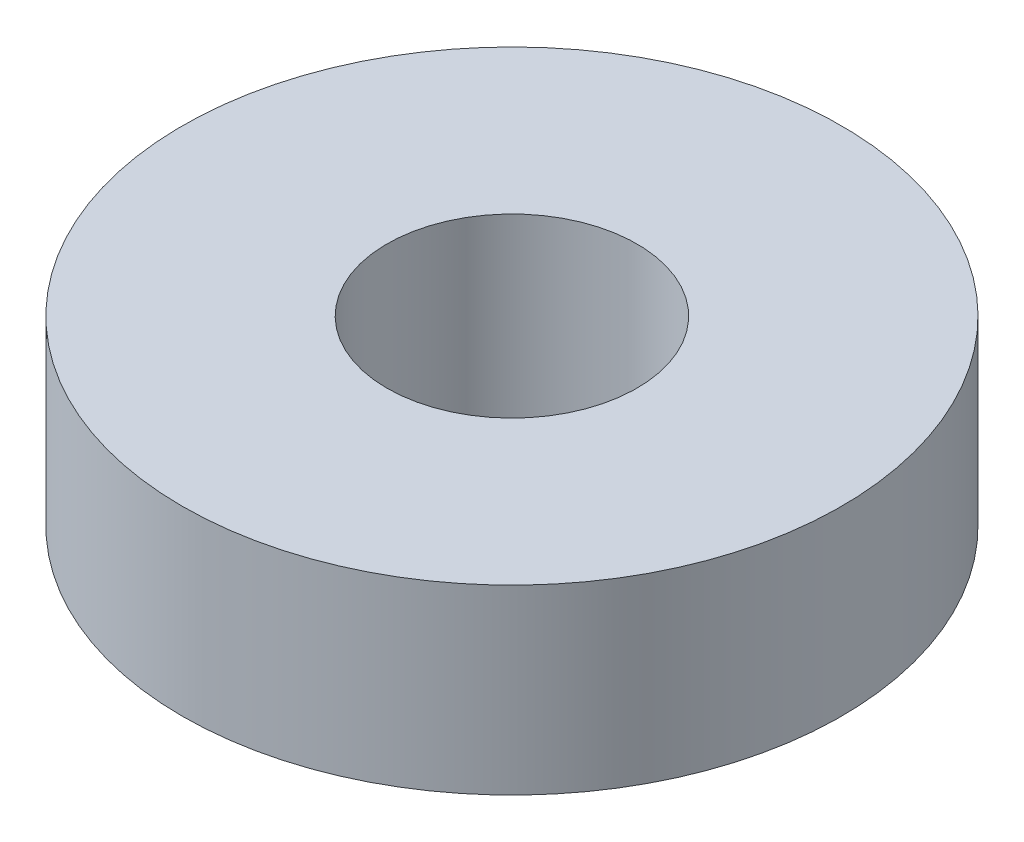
ISO-10303-21;
HEADER;
FILE_DESCRIPTION(('STEP AP214'),'2;1');
FILE_NAME('part.step','',(''),(''),'','','');
FILE_SCHEMA(('AUTOMOTIVE_DESIGN { 1 0 10303 214 1 1 1 1 }'));
ENDSEC;
DATA;
#1=APPLICATION_CONTEXT('core data for automotive mechanical design processes');
#2=APPLICATION_PROTOCOL_DEFINITION('international standard','automotive_design',2000,#1);
#3=PRODUCT_CONTEXT('',#1,'mechanical');
#4=PRODUCT('Part','Part','',(#3));
#5=PRODUCT_RELATED_PRODUCT_CATEGORY('part','',(#4));
#6=PRODUCT_DEFINITION_FORMATION('','',#4);
#7=PRODUCT_DEFINITION_CONTEXT('part definition',#1,'design');
#8=PRODUCT_DEFINITION('design','',#6,#7);
#9=PRODUCT_DEFINITION_SHAPE('','',#8);
#10=(LENGTH_UNIT() NAMED_UNIT(*) SI_UNIT(.MILLI.,.METRE.));
#11=(NAMED_UNIT(*) PLANE_ANGLE_UNIT() SI_UNIT($,.RADIAN.));
#12=(NAMED_UNIT(*) SI_UNIT($,.STERADIAN.) SOLID_ANGLE_UNIT());
#13=UNCERTAINTY_MEASURE_WITH_UNIT(LENGTH_MEASURE(1.E-05),#10,'distance_accuracy_value','');
#14=(GEOMETRIC_REPRESENTATION_CONTEXT(3) GLOBAL_UNCERTAINTY_ASSIGNED_CONTEXT((#13)) GLOBAL_UNIT_ASSIGNED_CONTEXT((#10,
#11,#12)) REPRESENTATION_CONTEXT('',''));
#15=CARTESIAN_POINT('',(0.,0.,0.));
#16=DIRECTION('',(0.,0.,1.));
#17=DIRECTION('',(1.,0.,0.));
#18=AXIS2_PLACEMENT_3D('',#15,#16,#17);
#19=CARTESIAN_POINT('',(0.,5.08,0.));
#20=DIRECTION('',(0.,1.,0.));
#21=DIRECTION('',(0.,0.,1.));
#22=AXIS2_PLACEMENT_3D('',#19,#20,#21);
#23=PLANE('',#22);
#24=CARTESIAN_POINT('',(0.,5.08,0.));
#25=DIRECTION('',(0.,1.,0.));
#26=DIRECTION('',(0.,0.,1.));
#27=AXIS2_PLACEMENT_3D('',#24,#25,#26);
#28=CIRCLE('',#27,9.2075);
#29=CARTESIAN_POINT('',(0.,5.08,9.2075));
#30=VERTEX_POINT('',#29);
#31=EDGE_CURVE('E10',#30,#30,#28,.T.);
#32=ORIENTED_EDGE('',*,*,#31,.T.);
#33=EDGE_LOOP('',(#32));
#34=FACE_BOUND('',#33,.T.);
#35=CARTESIAN_POINT('',(0.,5.08,0.));
#36=DIRECTION('',(0.,1.,0.));
#37=DIRECTION('',(0.,0.,1.));
#38=AXIS2_PLACEMENT_3D('',#35,#36,#37);
#39=CIRCLE('',#38,3.4925);
#40=CARTESIAN_POINT('',(0.,5.08,3.4925));
#41=VERTEX_POINT('',#40);
#42=EDGE_CURVE('E42',#41,#41,#39,.T.);
#43=ORIENTED_EDGE('',*,*,#42,.F.);
#44=EDGE_LOOP('',(#43));
#45=FACE_BOUND('',#44,.T.);
#46=ADVANCED_FACE('F31',(#34,#45),#23,.T.);
#47=CARTESIAN_POINT('',(0.,0.,0.));
#48=DIRECTION('',(0.,1.,0.));
#49=DIRECTION('',(0.,0.,1.));
#50=AXIS2_PLACEMENT_3D('',#47,#48,#49);
#51=PLANE('',#50);
#52=CARTESIAN_POINT('',(0.,0.,0.));
#53=DIRECTION('',(0.,1.,0.));
#54=DIRECTION('',(0.,0.,1.));
#55=AXIS2_PLACEMENT_3D('',#52,#53,#54);
#56=CIRCLE('',#55,9.2075);
#57=CARTESIAN_POINT('',(0.,0.,9.2075));
#58=VERTEX_POINT('',#57);
#59=EDGE_CURVE('E35',#58,#58,#56,.T.);
#60=ORIENTED_EDGE('',*,*,#59,.F.);
#61=EDGE_LOOP('',(#60));
#62=FACE_BOUND('',#61,.T.);
#63=CARTESIAN_POINT('',(0.,0.,0.));
#64=DIRECTION('',(0.,1.,0.));
#65=DIRECTION('',(0.,0.,1.));
#66=AXIS2_PLACEMENT_3D('',#63,#64,#65);
#67=CIRCLE('',#66,3.4925);
#68=CARTESIAN_POINT('',(0.,0.,3.4925));
#69=VERTEX_POINT('',#68);
#70=EDGE_CURVE('E44',#69,#69,#67,.T.);
#71=ORIENTED_EDGE('',*,*,#70,.T.);
#72=EDGE_LOOP('',(#71));
#73=FACE_BOUND('',#72,.T.);
#74=ADVANCED_FACE('F54',(#62,#73),#51,.F.);
#75=CARTESIAN_POINT('',(0.,5.08,0.));
#76=DIRECTION('',(0.,-1.,0.));
#77=DIRECTION('',(0.,0.,-1.));
#78=AXIS2_PLACEMENT_3D('',#75,#76,#77);
#79=CYLINDRICAL_SURFACE('',#78,9.2075);
#80=ORIENTED_EDGE('',*,*,#31,.F.);
#81=EDGE_LOOP('',(#80));
#82=FACE_BOUND('',#81,.T.);
#83=ORIENTED_EDGE('',*,*,#59,.T.);
#84=EDGE_LOOP('',(#83));
#85=FACE_BOUND('',#84,.T.);
#86=ADVANCED_FACE('F33',(#82,#85),#79,.T.);
#87=CARTESIAN_POINT('',(0.,5.08,0.));
#88=DIRECTION('',(0.,-1.,0.));
#89=DIRECTION('',(0.,0.,-1.));
#90=AXIS2_PLACEMENT_3D('',#87,#88,#89);
#91=CYLINDRICAL_SURFACE('',#90,3.4925);
#92=ORIENTED_EDGE('',*,*,#42,.T.);
#93=EDGE_LOOP('',(#92));
#94=FACE_BOUND('',#93,.T.);
#95=ORIENTED_EDGE('',*,*,#70,.F.);
#96=EDGE_LOOP('',(#95));
#97=FACE_BOUND('',#96,.T.);
#98=ADVANCED_FACE('F50',(#94,#97),#91,.F.);
#99=CLOSED_SHELL('',(#46,#74,#86,#98));
#100=MANIFOLD_SOLID_BREP('B2',#99);
#101=ADVANCED_BREP_SHAPE_REPRESENTATION('',(#18,#100),#14);
#102=SHAPE_DEFINITION_REPRESENTATION(#9,#101);
ENDSEC;
END-ISO-10303-21;
